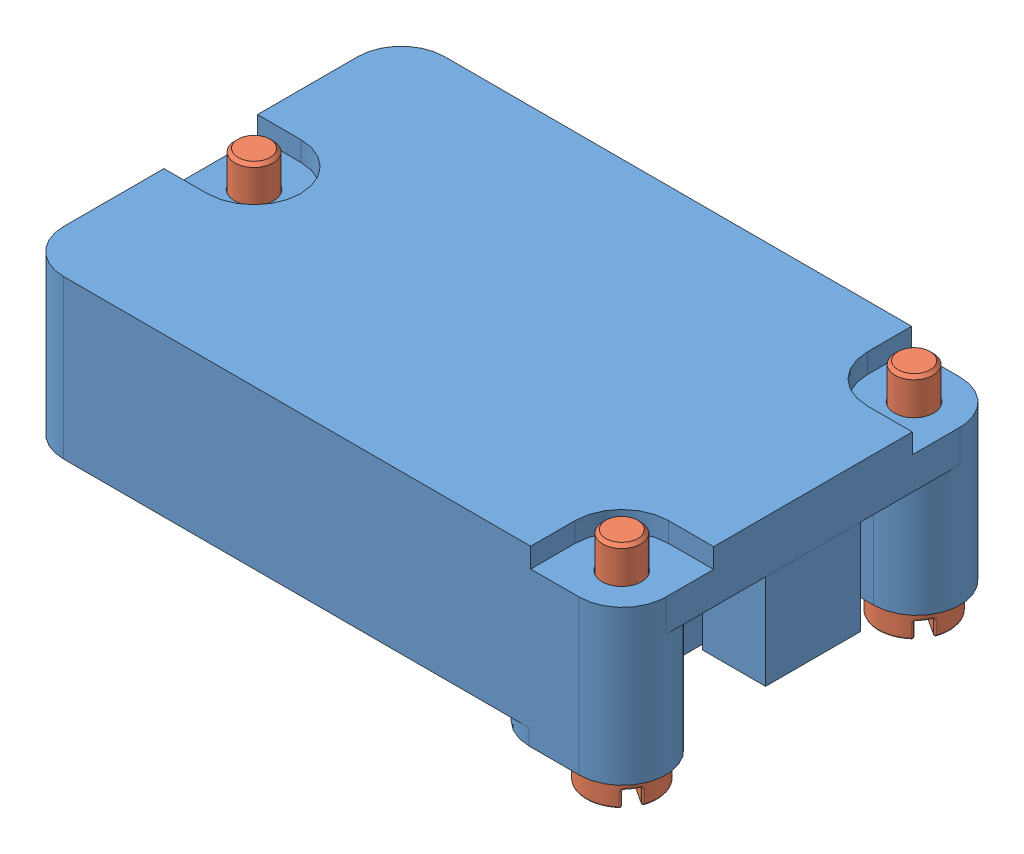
SolidWorks assembly imu_3dm_cx5_25.SLDASM, configuration Standard (file format 10000). Lengths in mm.
Overall size (38.74 13.7 24.72).
4 component instances, 2 part files, 6 mates.
Components (placement in the parent):
- imu_3dm_cx5_25-1: imu_3dm_cx5_25.SLDPRT [Standard] at origin size (38.1 11 24.1)
- fastener_shs_m2.5_12-1: fastener_shs_m2.5_12.SLDPRT [Standard] at (16.2 0 9.245) x (-0.837169 0 -0.546944) z (0 -1 0) size (4.5 4.5 13.7)
- fastener_shs_m2.5_12-2: fastener_shs_m2.5_12.SLDPRT [Standard] at (16.2 0 -9.245) x (-0.837169 0 -0.546944) z (0 -1 0) size (4.5 4.5 13.7)
- fastener_shs_m2.5_12-3: fastener_shs_m2.5_12.SLDPRT [Standard] at (-16.31 0 0) x (-0.837169 0 -0.546944) z (0 -1 0) size (4.5 4.5 13.7)
Mates (geometry in assembly coordinates):
- Konzentrisch1: concentric aligned: cylinder of imu_3dm_cx5_25-1 through (-16.31 11 0) axis (0 -1 0) radius 1.25; cylinder of fastener_shs_m2.5_12-3 through (-16.31 -21.9199 0) axis (0 -1 0) radius 1.21
- Konzentrisch2: concentric aligned: cylinder of imu_3dm_cx5_25-1 through (16.2 11 9.245) axis (0 -1 0) radius 1.25; cylinder of fastener_shs_m2.5_12-1 through (16.2 -21.9199 9.245) axis (0 -1 0) radius 1.21
- Konzentrisch3: concentric aligned: cylinder of imu_3dm_cx5_25-1 through (16.2 11 -9.245) axis (0 -1 0) radius 1.25; cylinder of fastener_shs_m2.5_12-2 through (16.2 -21.9199 -9.245) axis (0 -1 0) radius 1.21
- Deckungsgleich1: coincident anti-aligned: plane of imu_3dm_cx5_25-1 through (-16.31 0 9.31) normal (0 -1 0); plane of fastener_shs_m2.5_12-2 through (17.4306 0 -11.1286) normal (0 1 0)
- Deckungsgleich2: coincident anti-aligned: plane of imu_3dm_cx5_25-1 through (-16.31 0 9.31) normal (0 -1 0); plane of fastener_shs_m2.5_12-1 through (17.4306 0 7.3614) normal (0 1 0)
- Deckungsgleich3: coincident anti-aligned: plane of imu_3dm_cx5_25-1 through (-16.31 0 9.31) normal (0 -1 0); plane of fastener_shs_m2.5_12-3 through (-15.0794 0 -1.8836) normal (0 1 0)
